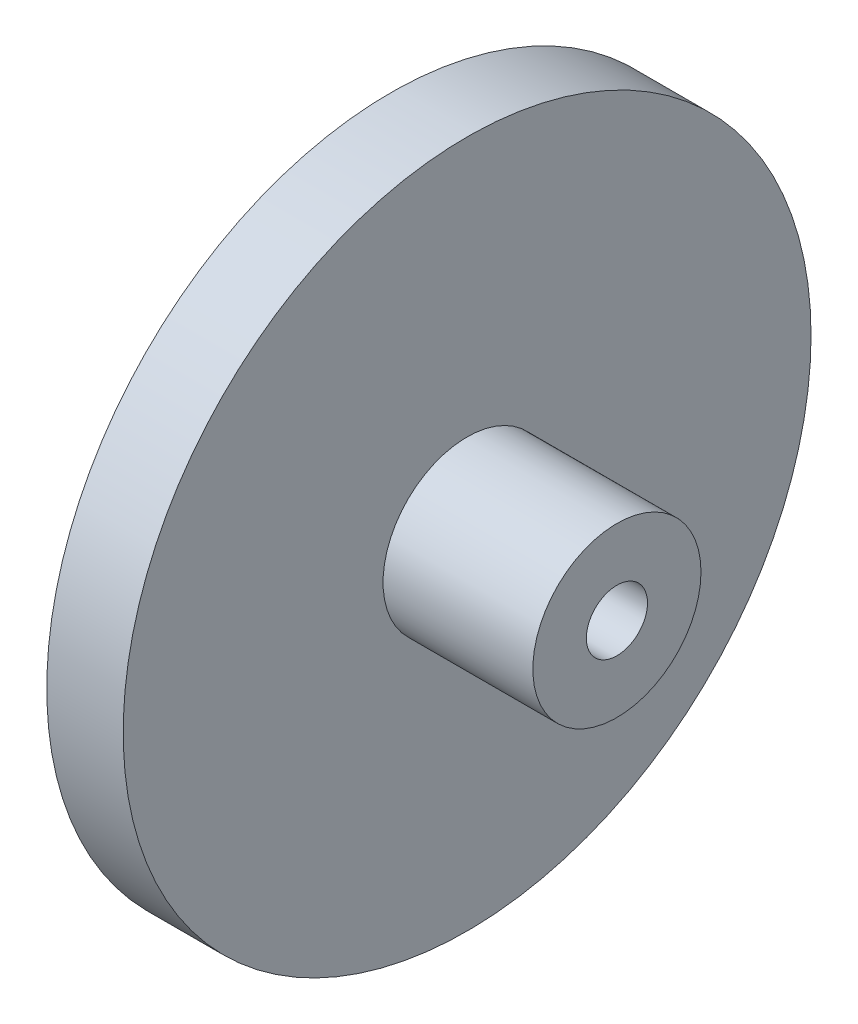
ISO-10303-21;
HEADER;
FILE_DESCRIPTION(('STEP AP214'),'2;1');
FILE_NAME('part.step','',(''),(''),'','','');
FILE_SCHEMA(('AUTOMOTIVE_DESIGN { 1 0 10303 214 1 1 1 1 }'));
ENDSEC;
DATA;
#1=APPLICATION_CONTEXT('core data for automotive mechanical design processes');
#2=APPLICATION_PROTOCOL_DEFINITION('international standard','automotive_design',2000,#1);
#3=PRODUCT_CONTEXT('',#1,'mechanical');
#4=PRODUCT('Part','Part','',(#3));
#5=PRODUCT_RELATED_PRODUCT_CATEGORY('part','',(#4));
#6=PRODUCT_DEFINITION_FORMATION('','',#4);
#7=PRODUCT_DEFINITION_CONTEXT('part definition',#1,'design');
#8=PRODUCT_DEFINITION('design','',#6,#7);
#9=PRODUCT_DEFINITION_SHAPE('','',#8);
#10=(LENGTH_UNIT() NAMED_UNIT(*) SI_UNIT(.MILLI.,.METRE.));
#11=(NAMED_UNIT(*) PLANE_ANGLE_UNIT() SI_UNIT($,.RADIAN.));
#12=(NAMED_UNIT(*) SI_UNIT($,.STERADIAN.) SOLID_ANGLE_UNIT());
#13=UNCERTAINTY_MEASURE_WITH_UNIT(LENGTH_MEASURE(1.E-05),#10,'distance_accuracy_value','');
#14=(GEOMETRIC_REPRESENTATION_CONTEXT(3) GLOBAL_UNCERTAINTY_ASSIGNED_CONTEXT((#13)) GLOBAL_UNIT_ASSIGNED_CONTEXT((#10,
#11,#12)) REPRESENTATION_CONTEXT('',''));
#15=CARTESIAN_POINT('',(0.,0.,0.));
#16=DIRECTION('',(0.,0.,1.));
#17=DIRECTION('',(1.,0.,0.));
#18=AXIS2_PLACEMENT_3D('',#15,#16,#17);
#19=CARTESIAN_POINT('',(-4.9,11.25,0.));
#20=DIRECTION('',(1.,0.,0.));
#21=DIRECTION('',(0.,0.,-1.));
#22=AXIS2_PLACEMENT_3D('',#19,#20,#21);
#23=PLANE('',#22);
#24=CARTESIAN_POINT('',(-4.9,0.,0.));
#25=DIRECTION('',(1.,0.,0.));
#26=DIRECTION('',(0.,0.,-1.));
#27=AXIS2_PLACEMENT_3D('',#24,#25,#26);
#28=CIRCLE('',#27,11.25);
#29=CARTESIAN_POINT('',(-4.9,0.,-11.25));
#30=VERTEX_POINT('',#29);
#31=EDGE_CURVE('E10',#30,#30,#28,.T.);
#32=ORIENTED_EDGE('',*,*,#31,.T.);
#33=EDGE_LOOP('',(#32));
#34=FACE_BOUND('',#33,.T.);
#35=CARTESIAN_POINT('',(-4.9,0.,0.));
#36=DIRECTION('',(1.,0.,0.));
#37=DIRECTION('',(0.,0.,-1.));
#38=AXIS2_PLACEMENT_3D('',#35,#36,#37);
#39=CIRCLE('',#38,2.75);
#40=CARTESIAN_POINT('',(-4.9,0.,-2.75));
#41=VERTEX_POINT('',#40);
#42=EDGE_CURVE('E61',#41,#41,#39,.T.);
#43=ORIENTED_EDGE('',*,*,#42,.F.);
#44=EDGE_LOOP('',(#43));
#45=FACE_BOUND('',#44,.T.);
#46=ADVANCED_FACE('F27',(#34,#45),#23,.T.);
#47=CARTESIAN_POINT('',(9.85897956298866,0.,0.));
#48=DIRECTION('',(1.,0.,0.));
#49=DIRECTION('',(0.,0.,-1.));
#50=AXIS2_PLACEMENT_3D('',#47,#48,#49);
#51=CYLINDRICAL_SURFACE('',#50,11.25);
#52=CARTESIAN_POINT('',(-7.4,0.,0.));
#53=DIRECTION('',(1.,0.,0.));
#54=DIRECTION('',(0.,0.,-1.));
#55=AXIS2_PLACEMENT_3D('',#52,#53,#54);
#56=CIRCLE('',#55,11.25);
#57=CARTESIAN_POINT('',(-7.4,0.,-11.25));
#58=VERTEX_POINT('',#57);
#59=EDGE_CURVE('E33',#58,#58,#56,.T.);
#60=ORIENTED_EDGE('',*,*,#59,.T.);
#61=EDGE_LOOP('',(#60));
#62=FACE_BOUND('',#61,.T.);
#63=ORIENTED_EDGE('',*,*,#31,.F.);
#64=EDGE_LOOP('',(#63));
#65=FACE_BOUND('',#64,.T.);
#66=ADVANCED_FACE('F69',(#62,#65),#51,.T.);
#67=CARTESIAN_POINT('',(-7.4,8.74999999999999,0.));
#68=DIRECTION('',(-1.,0.,0.));
#69=DIRECTION('',(0.,0.,1.));
#70=AXIS2_PLACEMENT_3D('',#67,#68,#69);
#71=PLANE('',#70);
#72=CARTESIAN_POINT('',(-7.4,0.,0.));
#73=DIRECTION('',(1.,0.,0.));
#74=DIRECTION('',(0.,0.,-1.));
#75=AXIS2_PLACEMENT_3D('',#72,#73,#74);
#76=CIRCLE('',#75,8.74999999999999);
#77=CARTESIAN_POINT('',(-7.4,0.,-8.74999999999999));
#78=VERTEX_POINT('',#77);
#79=EDGE_CURVE('E37',#78,#78,#76,.T.);
#80=ORIENTED_EDGE('',*,*,#79,.T.);
#81=EDGE_LOOP('',(#80));
#82=FACE_BOUND('',#81,.T.);
#83=ORIENTED_EDGE('',*,*,#59,.F.);
#84=EDGE_LOOP('',(#83));
#85=FACE_BOUND('',#84,.T.);
#86=ADVANCED_FACE('F73',(#82,#85),#71,.T.);
#87=CARTESIAN_POINT('',(-7.4,0.,0.));
#88=DIRECTION('',(-1.,0.,0.));
#89=DIRECTION('',(0.,0.,1.));
#90=AXIS2_PLACEMENT_3D('',#87,#88,#89);
#91=CONICAL_SURFACE('',#90,8.74999999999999,0.674740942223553);
#92=CARTESIAN_POINT('',(-6.15,0.,0.));
#93=DIRECTION('',(1.,0.,0.));
#94=DIRECTION('',(0.,0.,-1.));
#95=AXIS2_PLACEMENT_3D('',#92,#93,#94);
#96=CIRCLE('',#95,7.74999999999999);
#97=CARTESIAN_POINT('',(-6.15,0.,-7.74999999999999));
#98=VERTEX_POINT('',#97);
#99=EDGE_CURVE('E41',#98,#98,#96,.T.);
#100=ORIENTED_EDGE('',*,*,#99,.T.);
#101=EDGE_LOOP('',(#100));
#102=FACE_BOUND('',#101,.T.);
#103=ORIENTED_EDGE('',*,*,#79,.F.);
#104=EDGE_LOOP('',(#103));
#105=FACE_BOUND('',#104,.T.);
#106=ADVANCED_FACE('F77',(#102,#105),#91,.F.);
#107=CARTESIAN_POINT('',(-6.15,2.89999999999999,0.));
#108=DIRECTION('',(-1.,0.,0.));
#109=DIRECTION('',(0.,0.,1.));
#110=AXIS2_PLACEMENT_3D('',#107,#108,#109);
#111=PLANE('',#110);
#112=CARTESIAN_POINT('',(-6.15,0.,0.));
#113=DIRECTION('',(1.,0.,0.));
#114=DIRECTION('',(0.,0.,-1.));
#115=AXIS2_PLACEMENT_3D('',#112,#113,#114);
#116=CIRCLE('',#115,2.89999999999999);
#117=CARTESIAN_POINT('',(-6.15,0.,-2.89999999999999));
#118=VERTEX_POINT('',#117);
#119=EDGE_CURVE('E46',#118,#118,#116,.T.);
#120=ORIENTED_EDGE('',*,*,#119,.T.);
#121=EDGE_LOOP('',(#120));
#122=FACE_BOUND('',#121,.T.);
#123=ORIENTED_EDGE('',*,*,#99,.F.);
#124=EDGE_LOOP('',(#123));
#125=FACE_BOUND('',#124,.T.);
#126=ADVANCED_FACE('F84',(#122,#125),#111,.T.);
#127=CARTESIAN_POINT('',(9.85897956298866,0.,0.));
#128=DIRECTION('',(1.,0.,0.));
#129=DIRECTION('',(0.,0.,-1.));
#130=AXIS2_PLACEMENT_3D('',#127,#128,#129);
#131=CYLINDRICAL_SURFACE('',#130,2.89999999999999);
#132=CARTESIAN_POINT('',(-7.4,0.,0.));
#133=DIRECTION('',(1.,0.,0.));
#134=DIRECTION('',(0.,0.,-1.));
#135=AXIS2_PLACEMENT_3D('',#132,#133,#134);
#136=CIRCLE('',#135,2.89999999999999);
#137=CARTESIAN_POINT('',(-7.4,0.,-2.89999999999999));
#138=VERTEX_POINT('',#137);
#139=EDGE_CURVE('E49',#138,#138,#136,.T.);
#140=ORIENTED_EDGE('',*,*,#139,.T.);
#141=EDGE_LOOP('',(#140));
#142=FACE_BOUND('',#141,.T.);
#143=ORIENTED_EDGE('',*,*,#119,.F.);
#144=EDGE_LOOP('',(#143));
#145=FACE_BOUND('',#144,.T.);
#146=ADVANCED_FACE('F88',(#142,#145),#131,.T.);
#147=CARTESIAN_POINT('',(-7.4,0.999999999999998,0.));
#148=DIRECTION('',(-1.,0.,0.));
#149=DIRECTION('',(0.,0.,1.));
#150=AXIS2_PLACEMENT_3D('',#147,#148,#149);
#151=PLANE('',#150);
#152=CARTESIAN_POINT('',(-7.4,0.,0.));
#153=DIRECTION('',(1.,0.,0.));
#154=DIRECTION('',(0.,0.,-1.));
#155=AXIS2_PLACEMENT_3D('',#152,#153,#154);
#156=CIRCLE('',#155,0.999999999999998);
#157=CARTESIAN_POINT('',(-7.4,0.,-0.999999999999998));
#158=VERTEX_POINT('',#157);
#159=EDGE_CURVE('E52',#158,#158,#156,.T.);
#160=ORIENTED_EDGE('',*,*,#159,.T.);
#161=EDGE_LOOP('',(#160));
#162=FACE_BOUND('',#161,.T.);
#163=ORIENTED_EDGE('',*,*,#139,.F.);
#164=EDGE_LOOP('',(#163));
#165=FACE_BOUND('',#164,.T.);
#166=ADVANCED_FACE('F92',(#162,#165),#151,.T.);
#167=CARTESIAN_POINT('',(9.85897956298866,0.,0.));
#168=DIRECTION('',(1.,0.,0.));
#169=DIRECTION('',(0.,0.,-1.));
#170=AXIS2_PLACEMENT_3D('',#167,#168,#169);
#171=CYLINDRICAL_SURFACE('',#170,0.999999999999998);
#172=CARTESIAN_POINT('',(0.,0.,0.));
#173=DIRECTION('',(1.,0.,0.));
#174=DIRECTION('',(0.,0.,-1.));
#175=AXIS2_PLACEMENT_3D('',#172,#173,#174);
#176=CIRCLE('',#175,0.999999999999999);
#177=CARTESIAN_POINT('',(0.,0.,-0.999999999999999));
#178=VERTEX_POINT('',#177);
#179=EDGE_CURVE('E55',#178,#178,#176,.T.);
#180=ORIENTED_EDGE('',*,*,#179,.T.);
#181=EDGE_LOOP('',(#180));
#182=FACE_BOUND('',#181,.T.);
#183=ORIENTED_EDGE('',*,*,#159,.F.);
#184=EDGE_LOOP('',(#183));
#185=FACE_BOUND('',#184,.T.);
#186=ADVANCED_FACE('F96',(#182,#185),#171,.F.);
#187=CARTESIAN_POINT('',(0.,2.75,0.));
#188=DIRECTION('',(1.,0.,0.));
#189=DIRECTION('',(0.,0.,-1.));
#190=AXIS2_PLACEMENT_3D('',#187,#188,#189);
#191=PLANE('',#190);
#192=CARTESIAN_POINT('',(0.,0.,0.));
#193=DIRECTION('',(1.,0.,0.));
#194=DIRECTION('',(0.,0.,-1.));
#195=AXIS2_PLACEMENT_3D('',#192,#193,#194);
#196=CIRCLE('',#195,2.75);
#197=CARTESIAN_POINT('',(0.,0.,-2.75));
#198=VERTEX_POINT('',#197);
#199=EDGE_CURVE('E58',#198,#198,#196,.T.);
#200=ORIENTED_EDGE('',*,*,#199,.T.);
#201=EDGE_LOOP('',(#200));
#202=FACE_BOUND('',#201,.T.);
#203=ORIENTED_EDGE('',*,*,#179,.F.);
#204=EDGE_LOOP('',(#203));
#205=FACE_BOUND('',#204,.T.);
#206=ADVANCED_FACE('F100',(#202,#205),#191,.T.);
#207=CARTESIAN_POINT('',(9.85897956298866,0.,0.));
#208=DIRECTION('',(1.,0.,0.));
#209=DIRECTION('',(0.,0.,-1.));
#210=AXIS2_PLACEMENT_3D('',#207,#208,#209);
#211=CYLINDRICAL_SURFACE('',#210,2.75);
#212=ORIENTED_EDGE('',*,*,#42,.T.);
#213=EDGE_LOOP('',(#212));
#214=FACE_BOUND('',#213,.T.);
#215=ORIENTED_EDGE('',*,*,#199,.F.);
#216=EDGE_LOOP('',(#215));
#217=FACE_BOUND('',#216,.T.);
#218=ADVANCED_FACE('F65',(#214,#217),#211,.T.);
#219=CLOSED_SHELL('',(#46,#66,#86,#106,#126,#146,#166,#186,#206,#218));
#220=MANIFOLD_SOLID_BREP('B2',#219);
#221=ADVANCED_BREP_SHAPE_REPRESENTATION('',(#18,#220),#14);
#222=SHAPE_DEFINITION_REPRESENTATION(#9,#221);
ENDSEC;
END-ISO-10303-21;
